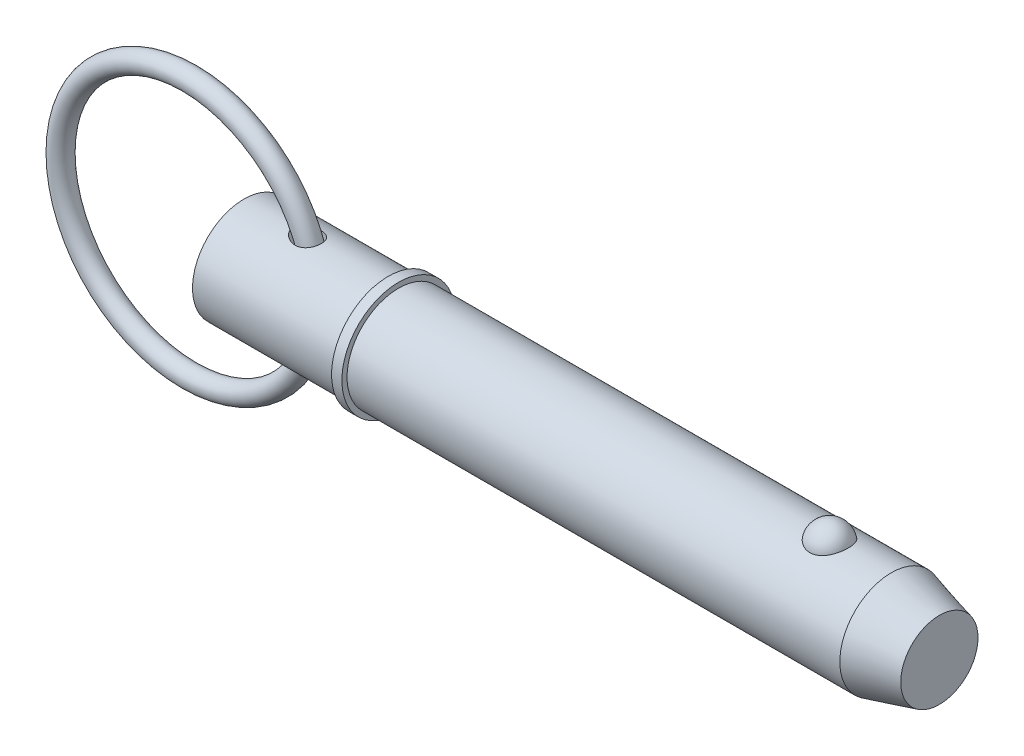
ISO-10303-21;
HEADER;
FILE_DESCRIPTION(('STEP AP214'),'2;1');
FILE_NAME('part.step','',(''),(''),'','','');
FILE_SCHEMA(('AUTOMOTIVE_DESIGN { 1 0 10303 214 1 1 1 1 }'));
ENDSEC;
DATA;
#1=APPLICATION_CONTEXT('core data for automotive mechanical design processes');
#2=APPLICATION_PROTOCOL_DEFINITION('international standard','automotive_design',2000,#1);
#3=PRODUCT_CONTEXT('',#1,'mechanical');
#4=PRODUCT('Part','Part','',(#3));
#5=PRODUCT_RELATED_PRODUCT_CATEGORY('part','',(#4));
#6=PRODUCT_DEFINITION_FORMATION('','',#4);
#7=PRODUCT_DEFINITION_CONTEXT('part definition',#1,'design');
#8=PRODUCT_DEFINITION('design','',#6,#7);
#9=PRODUCT_DEFINITION_SHAPE('','',#8);
#10=(LENGTH_UNIT() NAMED_UNIT(*) SI_UNIT(.MILLI.,.METRE.));
#11=(NAMED_UNIT(*) PLANE_ANGLE_UNIT() SI_UNIT($,.RADIAN.));
#12=(NAMED_UNIT(*) SI_UNIT($,.STERADIAN.) SOLID_ANGLE_UNIT());
#13=UNCERTAINTY_MEASURE_WITH_UNIT(LENGTH_MEASURE(1.E-05),#10,'distance_accuracy_value','');
#14=(GEOMETRIC_REPRESENTATION_CONTEXT(3) GLOBAL_UNCERTAINTY_ASSIGNED_CONTEXT((#13)) GLOBAL_UNIT_ASSIGNED_CONTEXT((#10,
#11,#12)) REPRESENTATION_CONTEXT('',''));
#15=CARTESIAN_POINT('',(0.,0.,0.));
#16=DIRECTION('',(0.,0.,1.));
#17=DIRECTION('',(1.,0.,0.));
#18=AXIS2_PLACEMENT_3D('',#15,#16,#17);
#19=CARTESIAN_POINT('',(-13.4840686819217,0.,0.));
#20=DIRECTION('',(0.,0.,1.));
#21=DIRECTION('',(1.,0.,0.));
#22=AXIS2_PLACEMENT_3D('',#19,#20,#21);
#23=TOROIDAL_SURFACE('',#22,31.75,2.54);
#24=CARTESIAN_POINT('',(20.8059313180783,0.,0.));
#25=VERTEX_POINT('',#24);
#26=VERTEX_LOOP('',#25);
#27=FACE_BOUND('',#26,.T.);
#28=ADVANCED_FACE('P0_F12',(#27),#23,.T.);
#29=CLOSED_SHELL('',(#28));
#30=MANIFOLD_SOLID_BREP('P0_B1',#29);
#31=CARTESIAN_POINT('',(0.,0.,0.));
#32=DIRECTION('',(1.,0.,0.));
#33=DIRECTION('',(0.,0.,-1.));
#34=AXIS2_PLACEMENT_3D('',#31,#32,#33);
#35=CYLINDRICAL_SURFACE('',#34,12.7);
#36=CARTESIAN_POINT('',(13.092900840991,12.5230976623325,-2.11234992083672));
#37=CARTESIAN_POINT('',(13.2535855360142,12.4976398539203,-2.26328363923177));
#38=CARTESIAN_POINT('',(13.4280602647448,12.4718592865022,-2.39955782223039));
#39=CARTESIAN_POINT('',(13.7976341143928,12.4229301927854,-2.64122157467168));
#40=CARTESIAN_POINT('',(13.9927568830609,12.3997847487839,-2.7465751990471));
#41=CARTESIAN_POINT('',(14.397672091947,12.3590534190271,-2.92439761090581));
#42=CARTESIAN_POINT('',(14.6074445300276,12.3414601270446,-2.99691026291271));
#43=CARTESIAN_POINT('',(15.0366557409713,12.3142893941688,-3.10669649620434));
#44=CARTESIAN_POINT('',(15.2560902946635,12.3047084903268,-3.14398530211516));
#45=CARTESIAN_POINT('',(15.5877843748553,12.2976819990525,-3.17128282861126));
#46=CARTESIAN_POINT('',(15.6989364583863,12.2965677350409,-3.17559470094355));
#47=CARTESIAN_POINT('',(15.9211629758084,12.2969101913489,-3.17427486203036));
#48=CARTESIAN_POINT('',(16.0322374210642,12.2983656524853,-3.16864802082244));
#49=CARTESIAN_POINT('',(16.2532861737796,12.3038832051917,-3.14715368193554));
#50=CARTESIAN_POINT('',(16.363260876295,12.3079443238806,-3.13129000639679));
#51=CARTESIAN_POINT('',(16.5810669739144,12.3185954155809,-3.08912320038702));
#52=CARTESIAN_POINT('',(16.6888986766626,12.3251850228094,-3.06282157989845));
#53=CARTESIAN_POINT('',(16.8894247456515,12.3398294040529,-3.00323791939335));
#54=CARTESIAN_POINT('',(16.9824664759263,12.3476389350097,-2.97106098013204));
#55=CARTESIAN_POINT('',(17.1651267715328,12.3648759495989,-2.89848824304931));
#56=CARTESIAN_POINT('',(17.2547457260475,12.3743032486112,-2.85809338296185));
#57=CARTESIAN_POINT('',(17.4297224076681,12.3944822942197,-2.76927391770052));
#58=CARTESIAN_POINT('',(17.5150817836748,12.40523352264,-2.72085245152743));
#59=CARTESIAN_POINT('',(17.6807665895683,12.4277046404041,-2.61629867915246));
#60=CARTESIAN_POINT('',(17.7610923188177,12.4394244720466,-2.56016683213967));
#61=CARTESIAN_POINT('',(17.9797287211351,12.4733252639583,-2.39133767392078));
#62=CARTESIAN_POINT('',(18.1114611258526,12.4961902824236,-2.27005507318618));
#63=CARTESIAN_POINT('',(18.3518677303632,12.5412050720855,-2.00648954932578));
#64=CARTESIAN_POINT('',(18.4605454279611,12.5633549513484,-1.86420981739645));
#65=CARTESIAN_POINT('',(18.6498843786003,12.6039384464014,-1.5661481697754));
#66=CARTESIAN_POINT('',(18.7311185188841,12.622444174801,-1.41073996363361));
#67=CARTESIAN_POINT('',(18.8669149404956,12.6543302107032,-1.08819514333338));
#68=CARTESIAN_POINT('',(18.921477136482,12.6677105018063,-0.921058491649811));
#69=CARTESIAN_POINT('',(19.0028875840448,12.6879542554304,-0.57902988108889));
#70=CARTESIAN_POINT('',(19.0296164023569,12.6947896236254,-0.40410783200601));
#71=CARTESIAN_POINT('',(19.0543673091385,12.7011128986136,-0.0521104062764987));
#72=CARTESIAN_POINT('',(19.0523885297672,12.7006005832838,0.124965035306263));
#73=CARTESIAN_POINT('',(19.019700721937,12.692266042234,0.476969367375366));
#74=CARTESIAN_POINT('',(18.9888798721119,12.6844153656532,0.651887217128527));
#75=CARTESIAN_POINT('',(18.8990221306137,12.6622099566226,0.99389064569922));
#76=CARTESIAN_POINT('',(18.839985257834,12.6478552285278,1.16097622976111));
#77=CARTESIAN_POINT('',(18.6951419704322,12.6142309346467,1.48231767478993));
#78=CARTESIAN_POINT('',(18.6093706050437,12.5949678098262,1.63659000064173));
#79=CARTESIAN_POINT('',(18.4131352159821,12.5536490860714,1.92810749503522));
#80=CARTESIAN_POINT('',(18.3026732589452,12.5315937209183,2.06535408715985));
#81=CARTESIAN_POINT('',(18.060669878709,12.4872833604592,2.31822774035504));
#82=CARTESIAN_POINT('',(17.9292520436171,12.4650302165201,2.43397343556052));
#83=CARTESIAN_POINT('',(17.6485957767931,12.4226514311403,2.64178289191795));
#84=CARTESIAN_POINT('',(17.4993587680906,12.4025256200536,2.73384854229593));
#85=CARTESIAN_POINT('',(17.1869531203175,12.3664726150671,2.8925825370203));
#86=CARTESIAN_POINT('',(17.0237450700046,12.3505578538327,2.95917592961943));
#87=CARTESIAN_POINT('',(16.6884731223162,12.3245177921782,3.06582547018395));
#88=CARTESIAN_POINT('',(16.516407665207,12.3143935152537,3.10587692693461));
#89=CARTESIAN_POINT('',(16.1604213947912,12.3003788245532,3.16093927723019));
#90=CARTESIAN_POINT('',(15.9763106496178,12.2967791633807,3.17478342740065));
#91=CARTESIAN_POINT('',(15.6080973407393,12.2966663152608,3.1752118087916));
#92=CARTESIAN_POINT('',(15.4239948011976,12.3001555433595,3.16178674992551));
#93=CARTESIAN_POINT('',(15.0417156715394,12.3141744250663,3.10676725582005));
#94=CARTESIAN_POINT('',(14.8439465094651,12.3253658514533,3.06251977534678));
#95=CARTESIAN_POINT('',(14.4574652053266,12.3538942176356,2.94531863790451));
#96=CARTESIAN_POINT('',(14.2687614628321,12.3712367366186,2.87233891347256));
#97=CARTESIAN_POINT('',(13.8856104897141,12.4121323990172,2.69045747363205));
#98=CARTESIAN_POINT('',(13.6926012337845,12.4361434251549,2.57861276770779));
#99=CARTESIAN_POINT('',(13.328588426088,12.4862632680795,2.32379935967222));
#100=CARTESIAN_POINT('',(13.1575718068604,12.5123708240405,2.18084927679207));
#101=CARTESIAN_POINT('',(12.8776146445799,12.5579467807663,1.89840233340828));
#102=CARTESIAN_POINT('',(12.7631663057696,12.5776642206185,1.76440341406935));
#103=CARTESIAN_POINT('',(12.5574911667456,12.6143643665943,1.47931295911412));
#104=CARTESIAN_POINT('',(12.4662309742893,12.6313509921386,1.32824646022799));
#105=CARTESIAN_POINT('',(12.3240650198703,12.6583901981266,1.03598403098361));
#106=CARTESIAN_POINT('',(12.2691183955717,12.6691064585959,0.89682285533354));
#107=CARTESIAN_POINT('',(12.1828741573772,12.6860954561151,0.611068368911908));
#108=CARTESIAN_POINT('',(12.1515620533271,12.6923709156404,0.464479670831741));
#109=CARTESIAN_POINT('',(12.1147168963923,12.6997676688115,0.167420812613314));
#110=CARTESIAN_POINT('',(12.109270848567,12.7008715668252,0.0169392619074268));
#111=CARTESIAN_POINT('',(12.1248234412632,12.6977391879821,-0.282592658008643));
#112=CARTESIAN_POINT('',(12.1458245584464,12.6935024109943,-0.431642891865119));
#113=CARTESIAN_POINT('',(12.210908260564,12.6805581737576,-0.716008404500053));
#114=CARTESIAN_POINT('',(12.2537133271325,12.6720986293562,-0.851633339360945));
#115=CARTESIAN_POINT('',(12.3591295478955,12.6516826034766,-1.11460776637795));
#116=CARTESIAN_POINT('',(12.4217455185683,12.6397252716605,-1.24195523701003));
#117=CARTESIAN_POINT('',(12.5735635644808,12.61152213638,-1.50300095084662));
#118=CARTESIAN_POINT('',(12.6652159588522,12.5949150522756,-1.63522875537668));
#119=CARTESIAN_POINT('',(12.8664347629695,12.5599626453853,-1.88501670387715));
#120=CARTESIAN_POINT('',(12.9760196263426,12.541615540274,-2.00256151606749));
#121=CARTESIAN_POINT('',(13.092900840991,12.5230976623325,-2.11234992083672));
#122=B_SPLINE_CURVE_WITH_KNOTS('',3,(#36,#37,#38,#39,#40,#41,#42,#43,#44,#45,#46,#47,#48,#49,
#50,#51,#52,#53,#54,#55,#56,#57,#58,#59,#60,#61,#62,#63,#64,#65,#66,#67,#68,#69,#70,#71,#72,#73,
#74,#75,#76,#77,#78,#79,#80,#81,#82,#83,#84,#85,#86,#87,#88,#89,#90,#91,#92,#93,#94,#95,#96,#97,
#98,#99,#100,#101,#102,#103,#104,#105,#106,#107,#108,#109,#110,#111,#112,#113,#114,#115,#116,
#117,#118,#119,#120,#121),.UNSPECIFIED.,.T.,.F.,(4,2,2,2,2,2,2,2,2,2,2,2,2,2,2,2,2,2,2,2,2,2,2,
2,2,2,2,2,2,2,2,2,2,2,2,2,2,2,2,2,2,2,4),(0.,0.665132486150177,1.33103515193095,
1.99604575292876,2.66076878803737,2.99410229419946,3.32727250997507,3.66031840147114,
3.99331613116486,4.28918991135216,4.58502994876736,4.88075456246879,5.17646157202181,
5.71510826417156,6.25367317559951,6.78017774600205,7.30668400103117,7.83544030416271,
8.36421259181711,8.89504347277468,9.42587399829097,9.95601150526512,10.4861046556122,
11.0131799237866,11.54021312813,12.0687854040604,12.597451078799,13.1491450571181,
13.7010270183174,14.3074556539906,14.914435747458,15.5844380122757,16.2540403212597,
16.7839879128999,17.3131679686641,17.7612578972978,18.2090728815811,18.658393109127,
19.1077554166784,19.5333866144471,19.959121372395,20.4424347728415,20.9262486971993),.UNSPECIFIED.);
#123=CARTESIAN_POINT('',(13.092900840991,12.5230976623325,-2.11234992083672));
#124=VERTEX_POINT('',#123);
#125=EDGE_CURVE('P1_E42',#124,#124,#122,.T.);
#126=ORIENTED_EDGE('',*,*,#125,.T.);
#127=EDGE_LOOP('',(#126));
#128=FACE_BOUND('',#127,.T.);
#129=CARTESIAN_POINT('',(0.,0.,0.));
#130=DIRECTION('',(1.,0.,0.));
#131=DIRECTION('',(0.,0.,-1.));
#132=AXIS2_PLACEMENT_3D('',#129,#130,#131);
#133=CIRCLE('',#132,12.7);
#134=CARTESIAN_POINT('',(0.,0.,-12.7));
#135=VERTEX_POINT('',#134);
#136=EDGE_CURVE('P1_E9',#135,#135,#133,.T.);
#137=ORIENTED_EDGE('',*,*,#136,.T.);
#138=EDGE_LOOP('',(#137));
#139=FACE_BOUND('',#138,.T.);
#140=CARTESIAN_POINT('',(35.56,0.,0.));
#141=DIRECTION('',(1.,0.,0.));
#142=DIRECTION('',(0.,0.,-1.));
#143=AXIS2_PLACEMENT_3D('',#140,#141,#142);
#144=CIRCLE('',#143,12.7);
#145=CARTESIAN_POINT('',(35.56,0.,-12.7));
#146=VERTEX_POINT('',#145);
#147=EDGE_CURVE('P1_E25',#146,#146,#144,.T.);
#148=ORIENTED_EDGE('',*,*,#147,.F.);
#149=EDGE_LOOP('',(#148));
#150=FACE_BOUND('',#149,.T.);
#151=CARTESIAN_POINT('',(13.092900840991,-12.5230976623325,-2.11234992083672));
#152=CARTESIAN_POINT('',(12.9659872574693,-12.5432050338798,-1.99314161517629));
#153=CARTESIAN_POINT('',(12.847667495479,-12.5631124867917,-1.86478966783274));
#154=CARTESIAN_POINT('',(12.6324721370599,-12.6007427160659,-1.59069749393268));
#155=CARTESIAN_POINT('',(12.5355833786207,-12.6184668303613,-1.444968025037));
#156=CARTESIAN_POINT('',(12.4099071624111,-12.642034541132,-1.21450950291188));
#157=CARTESIAN_POINT('',(12.3711427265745,-12.6494175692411,-1.13527163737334));
#158=CARTESIAN_POINT('',(12.3010994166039,-12.6628962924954,-0.973464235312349));
#159=CARTESIAN_POINT('',(12.2698164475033,-12.6689926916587,-0.890896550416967));
#160=CARTESIAN_POINT('',(12.2153933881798,-12.6796767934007,-0.72309085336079));
#161=CARTESIAN_POINT('',(12.192246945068,-12.6842656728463,-0.637854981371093));
#162=CARTESIAN_POINT('',(12.154603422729,-12.6917620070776,-0.465421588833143));
#163=CARTESIAN_POINT('',(12.1401047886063,-12.69466976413,-0.378224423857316));
#164=CARTESIAN_POINT('',(12.1214471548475,-12.6984180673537,-0.214417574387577));
#165=CARTESIAN_POINT('',(12.1161713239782,-12.699481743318,-0.13793855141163));
#166=CARTESIAN_POINT('',(12.1124989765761,-12.7002217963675,0.0152189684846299));
#167=CARTESIAN_POINT('',(12.1141046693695,-12.6998977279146,0.0918975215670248));
#168=CARTESIAN_POINT('',(12.1241695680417,-12.6978712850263,0.244746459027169));
#169=CARTESIAN_POINT('',(12.132625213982,-12.6961696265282,0.320917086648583));
#170=CARTESIAN_POINT('',(12.1562110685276,-12.6914452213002,0.472185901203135));
#171=CARTESIAN_POINT('',(12.1713438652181,-12.6884219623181,0.547283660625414));
#172=CARTESIAN_POINT('',(12.223731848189,-12.6780227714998,0.759415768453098));
#173=CARTESIAN_POINT('',(12.268839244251,-12.6691353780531,0.894507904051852));
#174=CARTESIAN_POINT('',(12.3786059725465,-12.6479567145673,1.1560647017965));
#175=CARTESIAN_POINT('',(12.4432700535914,-12.6356646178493,1.28252725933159));
#176=CARTESIAN_POINT('',(12.5971341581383,-12.607236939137,1.5381272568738));
#177=CARTESIAN_POINT('',(12.6882234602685,-12.5908303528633,1.66609325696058));
#178=CARTESIAN_POINT('',(12.887209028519,-12.5564642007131,1.90792082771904));
#179=CARTESIAN_POINT('',(12.995115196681,-12.5385037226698,2.02177401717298));
#180=CARTESIAN_POINT('',(13.2471335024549,-12.4987806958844,2.25547266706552));
#181=CARTESIAN_POINT('',(13.3941979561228,-12.4769622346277,2.3721269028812));
#182=CARTESIAN_POINT('',(13.7036983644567,-12.4349587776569,2.58329351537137));
#183=CARTESIAN_POINT('',(13.8661464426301,-12.4147750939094,2.67778822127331));
#184=CARTESIAN_POINT('',(14.2306024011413,-12.3748157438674,2.85722657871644));
#185=CARTESIAN_POINT('',(14.4347220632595,-12.3556533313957,2.93804226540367));
#186=CARTESIAN_POINT('',(14.8540416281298,-12.3245430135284,3.06594877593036));
#187=CARTESIAN_POINT('',(15.0692453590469,-12.3125976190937,3.11302786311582));
#188=CARTESIAN_POINT('',(15.3981213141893,-12.3014943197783,3.15648626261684));
#189=CARTESIAN_POINT('',(15.5100235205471,-12.298940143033,3.16639841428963));
#190=CARTESIAN_POINT('',(15.7342812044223,-12.2963942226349,3.17627668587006));
#191=CARTESIAN_POINT('',(15.8466364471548,-12.2964012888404,3.17624742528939));
#192=CARTESIAN_POINT('',(16.0707903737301,-12.2990694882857,3.16589868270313));
#193=CARTESIAN_POINT('',(16.1825892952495,-12.3017293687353,3.1555840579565));
#194=CARTESIAN_POINT('',(16.4046123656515,-12.3096862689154,3.12440163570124));
#195=CARTESIAN_POINT('',(16.514836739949,-12.314982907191,3.10353536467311));
#196=CARTESIAN_POINT('',(16.7211934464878,-12.3273933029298,3.05384263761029));
#197=CARTESIAN_POINT('',(16.8175961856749,-12.3342598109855,3.0260738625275));
#198=CARTESIAN_POINT('',(17.0073515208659,-12.3498131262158,2.96195947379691));
#199=CARTESIAN_POINT('',(17.100704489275,-12.3584997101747,2.92561491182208));
#200=CARTESIAN_POINT('',(17.2834584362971,-12.3774243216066,2.84448580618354));
#201=CARTESIAN_POINT('',(17.3728610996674,-12.3876616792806,2.79970490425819));
#202=CARTESIAN_POINT('',(17.5469061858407,-12.409352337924,2.701939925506));
#203=CARTESIAN_POINT('',(17.6315489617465,-12.4208055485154,2.64895645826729));
#204=CARTESIAN_POINT('',(17.7872886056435,-12.4433734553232,2.54070972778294));
#205=CARTESIAN_POINT('',(17.8589017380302,-12.4544123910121,2.4861716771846));
#206=CARTESIAN_POINT('',(17.9970802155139,-12.4768404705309,2.37105291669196));
#207=CARTESIAN_POINT('',(18.063643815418,-12.4882297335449,2.31047013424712));
#208=CARTESIAN_POINT('',(18.1911677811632,-12.5110137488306,2.18372894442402));
#209=CARTESIAN_POINT('',(18.2521311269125,-12.5224084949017,2.11757353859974));
#210=CARTESIAN_POINT('',(18.3680676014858,-12.5448751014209,1.98014449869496));
#211=CARTESIAN_POINT('',(18.4230385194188,-12.5559468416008,1.90886899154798));
#212=CARTESIAN_POINT('',(18.5752306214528,-12.5875288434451,1.6925769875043));
#213=CARTESIAN_POINT('',(18.6637018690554,-12.6071482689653,1.54111740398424));
#214=CARTESIAN_POINT('',(18.8143485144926,-12.6417556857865,1.225260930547));
#215=CARTESIAN_POINT('',(18.876524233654,-12.6567437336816,1.06086419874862));
#216=CARTESIAN_POINT('',(18.9733884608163,-12.6805238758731,0.723195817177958));
#217=CARTESIAN_POINT('',(19.0079967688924,-12.6892978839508,0.549899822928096));
#218=CARTESIAN_POINT('',(19.0486500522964,-12.6996362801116,0.199781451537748));
#219=CARTESIAN_POINT('',(19.054694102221,-12.7012004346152,0.0229589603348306));
#220=CARTESIAN_POINT('',(19.0380549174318,-12.6969431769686,-0.330044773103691));
#221=CARTESIAN_POINT('',(19.0152419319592,-12.6910884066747,-0.506219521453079));
#222=CARTESIAN_POINT('',(18.9411599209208,-12.672565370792,-0.852112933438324));
#223=CARTESIAN_POINT('',(18.8898907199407,-12.659897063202,-1.0218315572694));
#224=CARTESIAN_POINT('',(18.7600888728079,-12.6291327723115,-1.34987035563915));
#225=CARTESIAN_POINT('',(18.6815715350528,-12.6110398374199,-1.50819687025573));
#226=CARTESIAN_POINT('',(18.4991526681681,-12.5714188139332,-1.808997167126));
#227=CARTESIAN_POINT('',(18.3952529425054,-12.5498909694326,-1.95147207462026));
#228=CARTESIAN_POINT('',(18.1653806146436,-12.5059234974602,-2.21580059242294));
#229=CARTESIAN_POINT('',(18.0395297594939,-12.4834893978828,-2.33776101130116));
#230=CARTESIAN_POINT('',(17.7688701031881,-12.4400863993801,-2.55870399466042));
#231=CARTESIAN_POINT('',(17.624063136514,-12.4191173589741,-2.65768878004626));
#232=CARTESIAN_POINT('',(17.3196803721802,-12.380896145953,-2.8304192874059));
#233=CARTESIAN_POINT('',(17.1601036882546,-12.3636441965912,-2.90416349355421));
#234=CARTESIAN_POINT('',(16.8308162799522,-12.3345597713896,-3.02531546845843));
#235=CARTESIAN_POINT('',(16.6611041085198,-12.322728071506,-3.07271946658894));
#236=CARTESIAN_POINT('',(16.3099674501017,-12.3051318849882,-3.14246490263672));
#237=CARTESIAN_POINT('',(16.1283412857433,-12.2996014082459,-3.16384159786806));
#238=CARTESIAN_POINT('',(15.7639014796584,-12.2955807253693,-3.17942379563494));
#239=CARTESIAN_POINT('',(15.5810875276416,-12.2970924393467,-3.17362188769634));
#240=CARTESIAN_POINT('',(15.20154276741,-12.307074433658,-3.13470416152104));
#241=CARTESIAN_POINT('',(15.0050835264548,-12.316173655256,-3.09911848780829));
#242=CARTESIAN_POINT('',(14.6197996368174,-12.3407987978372,-2.99954607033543));
#243=CARTESIAN_POINT('',(14.4309834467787,-12.3563316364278,-2.93552875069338));
#244=CARTESIAN_POINT('',(14.0353751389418,-12.3949378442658,-2.76840280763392));
#245=CARTESIAN_POINT('',(13.8306109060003,-12.4188242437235,-2.66064798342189));
#246=CARTESIAN_POINT('',(13.4432099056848,-12.4696241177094,-2.4113475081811));
#247=CARTESIAN_POINT('',(13.2605568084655,-12.4965353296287,-2.26982702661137));
#248=CARTESIAN_POINT('',(13.092900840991,-12.5230976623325,-2.11234992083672));
#249=B_SPLINE_CURVE_WITH_KNOTS('',3,(#151,#152,#153,#154,#155,#156,#157,#158,#159,#160,#161,
#162,#163,#164,#165,#166,#167,#168,#169,#170,#171,#172,#173,#174,#175,#176,#177,#178,#179,#180,
#181,#182,#183,#184,#185,#186,#187,#188,#189,#190,#191,#192,#193,#194,#195,#196,#197,#198,#199,
#200,#201,#202,#203,#204,#205,#206,#207,#208,#209,#210,#211,#212,#213,#214,#215,#216,#217,#218,
#219,#220,#221,#222,#223,#224,#225,#226,#227,#228,#229,#230,#231,#232,#233,#234,#235,#236,#237,
#238,#239,#240,#241,#242,#243,#244,#245,#246,#247,#248),.UNSPECIFIED.,.T.,.F.,(4,2,2,2,2,2,2,2,
2,2,2,2,2,2,2,2,2,2,2,2,2,2,2,2,2,2,2,2,2,2,2,2,2,2,2,2,2,2,2,2,2,2,2,2,2,2,2,2,4),(0.,
0.525289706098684,1.05025590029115,1.31549608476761,1.58059075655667,1.84547798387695,
2.11031756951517,2.34000998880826,2.56977615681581,2.79942299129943,3.0291589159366,
3.45531787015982,3.8815803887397,4.35362362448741,4.82594586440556,5.39074449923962,
5.95599200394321,6.61421946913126,7.27267581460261,7.60939383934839,7.94595540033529,
8.2823580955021,8.61871213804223,8.91997243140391,9.22119579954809,9.52228943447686,
9.82336070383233,10.0950952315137,10.3669232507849,10.6386057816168,10.9103882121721,
11.4371688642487,11.9639430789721,12.4922442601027,13.0205625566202,13.5512648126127,
14.0819703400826,14.6123781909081,15.1427483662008,15.6702654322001,16.1977314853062,
16.7252292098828,17.2528024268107,17.7993878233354,18.3461222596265,18.9432829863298,
19.5410874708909,20.2355241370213,20.9294447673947),.UNSPECIFIED.);
#250=CARTESIAN_POINT('',(13.092900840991,-12.5230976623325,-2.11234992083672));
#251=VERTEX_POINT('',#250);
#252=EDGE_CURVE('P1_E17',#251,#251,#249,.T.);
#253=ORIENTED_EDGE('',*,*,#252,.T.);
#254=EDGE_LOOP('',(#253));
#255=FACE_BOUND('',#254,.T.);
#256=ADVANCED_FACE('P1_F13',(#128,#139,#150,#255),#35,.T.);
#257=CARTESIAN_POINT('',(0.,0.,0.));
#258=DIRECTION('',(1.,0.,0.));
#259=DIRECTION('',(0.,0.,-1.));
#260=AXIS2_PLACEMENT_3D('',#257,#258,#259);
#261=CYLINDRICAL_SURFACE('',#260,12.7);
#262=CARTESIAN_POINT('',(159.600738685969,0.,0.));
#263=DIRECTION('',(1.,0.,0.));
#264=DIRECTION('',(0.,0.,-1.));
#265=AXIS2_PLACEMENT_3D('',#262,#263,#264);
#266=CIRCLE('',#265,12.7);
#267=CARTESIAN_POINT('',(159.600738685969,0.,-12.7));
#268=VERTEX_POINT('',#267);
#269=EDGE_CURVE('P1_E99',#268,#268,#266,.T.);
#270=ORIENTED_EDGE('',*,*,#269,.F.);
#271=EDGE_LOOP('',(#270));
#272=FACE_BOUND('',#271,.T.);
#273=CARTESIAN_POINT('',(38.1,0.,0.));
#274=DIRECTION('',(1.,0.,0.));
#275=DIRECTION('',(0.,0.,-1.));
#276=AXIS2_PLACEMENT_3D('',#273,#274,#275);
#277=CIRCLE('',#276,12.7);
#278=CARTESIAN_POINT('',(38.1,0.,-12.7));
#279=VERTEX_POINT('',#278);
#280=EDGE_CURVE('P1_E96',#279,#279,#277,.T.);
#281=ORIENTED_EDGE('',*,*,#280,.T.);
#282=EDGE_LOOP('',(#281));
#283=FACE_BOUND('',#282,.T.);
#284=CARTESIAN_POINT('',(144.360042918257,11.7500437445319,4.81938502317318));
#285=CARTESIAN_POINT('',(144.235088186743,11.7500430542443,4.81938571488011));
#286=CARTESIAN_POINT('',(144.110144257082,11.7520975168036,4.81438658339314));
#287=CARTESIAN_POINT('',(143.861142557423,11.760253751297,4.79442904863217));
#288=CARTESIAN_POINT('',(143.737085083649,11.7663568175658,4.77946746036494));
#289=CARTESIAN_POINT('',(143.490901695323,11.7824262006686,4.73971414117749));
#290=CARTESIAN_POINT('',(143.368774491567,11.7923898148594,4.71492928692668));
#291=CARTESIAN_POINT('',(143.127187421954,11.8158938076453,4.65571340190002));
#292=CARTESIAN_POINT('',(143.00772859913,11.8294355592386,4.6212786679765));
#293=CARTESIAN_POINT('',(142.772557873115,11.8596812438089,4.54309502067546));
#294=CARTESIAN_POINT('',(142.656839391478,11.8763792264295,4.49936361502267));
#295=CARTESIAN_POINT('',(142.429653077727,11.9124878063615,4.40287235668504));
#296=CARTESIAN_POINT('',(142.318186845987,11.9318994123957,4.35010914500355));
#297=CARTESIAN_POINT('',(141.991278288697,11.9934256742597,4.17881316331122));
#298=CARTESIAN_POINT('',(141.783127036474,12.038858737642,4.04720756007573));
#299=CARTESIAN_POINT('',(141.385850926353,12.1352173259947,3.748564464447));
#300=CARTESIAN_POINT('',(141.197443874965,12.1862630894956,3.58061821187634));
#301=CARTESIAN_POINT('',(140.850521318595,12.2875163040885,3.21600758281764));
#302=CARTESIAN_POINT('',(140.692011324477,12.3377235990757,3.01933792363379));
#303=CARTESIAN_POINT('',(140.40168878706,12.4344923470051,2.59291655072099));
#304=CARTESIAN_POINT('',(140.271376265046,12.4807925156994,2.36208286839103));
#305=CARTESIAN_POINT('',(140.049407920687,12.5623454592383,1.88070399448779));
#306=CARTESIAN_POINT('',(139.957755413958,12.5975972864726,1.63015711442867));
#307=CARTESIAN_POINT('',(139.814046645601,12.6538414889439,1.1129886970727));
#308=CARTESIAN_POINT('',(139.762499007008,12.6746503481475,0.846205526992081));
#309=CARTESIAN_POINT('',(139.701977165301,12.699153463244,0.30708547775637));
#310=CARTESIAN_POINT('',(139.693001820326,12.7028481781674,0.034748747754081));
#311=CARTESIAN_POINT('',(139.717731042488,12.6927785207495,-0.506073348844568));
#312=CARTESIAN_POINT('',(139.751189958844,12.6791146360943,-0.774571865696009));
#313=CARTESIAN_POINT('',(139.859687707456,12.635882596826,-1.30170246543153));
#314=CARTESIAN_POINT('',(139.93472729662,12.606314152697,-1.56033436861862));
#315=CARTESIAN_POINT('',(140.12500006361,12.5342328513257,-2.0608389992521));
#316=CARTESIAN_POINT('',(140.240287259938,12.4917026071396,-2.30268867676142));
#317=CARTESIAN_POINT('',(140.508704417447,12.3981123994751,-2.76259600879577));
#318=CARTESIAN_POINT('',(140.661837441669,12.3470517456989,-2.98065173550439));
#319=CARTESIAN_POINT('',(141.003507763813,12.2416045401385,-3.38786328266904));
#320=CARTESIAN_POINT('',(141.192201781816,12.1872040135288,-3.57688418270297));
#321=CARTESIAN_POINT('',(141.600239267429,12.0814086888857,-3.91941073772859));
#322=CARTESIAN_POINT('',(141.819580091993,12.0300136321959,-4.07291945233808));
#323=CARTESIAN_POINT('',(142.278375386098,11.9373542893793,-4.33691289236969));
#324=CARTESIAN_POINT('',(142.517304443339,11.8958982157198,-4.44824125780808));
#325=CARTESIAN_POINT('',(143.01243761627,11.8268116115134,-4.62881985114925));
#326=CARTESIAN_POINT('',(143.268635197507,11.7991758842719,-4.69808589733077));
#327=CARTESIAN_POINT('',(143.777164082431,11.7622209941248,-4.78983181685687));
#328=CARTESIAN_POINT('',(144.029041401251,11.7520502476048,-4.81449025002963));
#329=CARTESIAN_POINT('',(144.533573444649,11.7485796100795,-4.82295735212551));
#330=CARTESIAN_POINT('',(144.786228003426,11.7552763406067,-4.80677420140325));
#331=CARTESIAN_POINT('',(145.276834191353,11.7842584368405,-4.73525430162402));
#332=CARTESIAN_POINT('',(145.514998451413,11.8060486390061,-4.68116061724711));
#333=CARTESIAN_POINT('',(145.978489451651,11.8622750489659,-4.53678133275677));
#334=CARTESIAN_POINT('',(146.203815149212,11.8967122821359,-4.44649279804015));
#335=CARTESIAN_POINT('',(146.640801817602,11.9754603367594,-4.22987613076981));
#336=CARTESIAN_POINT('',(146.852057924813,12.0199699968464,-4.10280539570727));
#337=CARTESIAN_POINT('',(147.250601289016,12.1138028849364,-3.81685409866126));
#338=CARTESIAN_POINT('',(147.437883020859,12.163127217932,-3.65796622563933));
#339=CARTESIAN_POINT('',(147.793350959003,12.2642343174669,-3.30364864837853));
#340=CARTESIAN_POINT('',(147.960111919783,12.3160165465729,-3.10678783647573));
#341=CARTESIAN_POINT('',(148.259579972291,12.4142566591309,-2.68748409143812));
#342=CARTESIAN_POINT('',(148.392280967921,12.4607135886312,-2.46503658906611));
#343=CARTESIAN_POINT('',(148.624691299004,12.5450236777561,-1.9928951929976));
#344=CARTESIAN_POINT('',(148.723215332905,12.5825557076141,-1.74255918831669));
#345=CARTESIAN_POINT('',(148.879227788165,12.6431720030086,-1.2277373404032));
#346=CARTESIAN_POINT('',(148.936715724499,12.6662560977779,-0.963251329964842));
#347=CARTESIAN_POINT('',(149.009544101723,12.6956486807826,-0.427355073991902));
#348=CARTESIAN_POINT('',(149.024837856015,12.7019385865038,-0.155937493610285));
#349=CARTESIAN_POINT('',(149.012779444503,12.6970201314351,0.385928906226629));
#350=CARTESIAN_POINT('',(148.98542805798,12.6858120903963,0.656377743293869));
#351=CARTESIAN_POINT('',(148.913060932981,12.6568455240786,1.05454017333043));
#352=CARTESIAN_POINT('',(148.883796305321,12.6451962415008,1.185778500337));
#353=CARTESIAN_POINT('',(148.815022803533,12.6181819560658,1.44513808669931));
#354=CARTESIAN_POINT('',(148.775517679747,12.6028183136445,1.57326046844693));
#355=CARTESIAN_POINT('',(148.686439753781,12.5687547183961,1.82554978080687));
#356=CARTESIAN_POINT('',(148.636862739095,12.5500533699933,1.9497150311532));
#357=CARTESIAN_POINT('',(148.52792115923,12.5098093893,2.19314370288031));
#358=CARTESIAN_POINT('',(148.468560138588,12.4882677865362,2.31240887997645));
#359=CARTESIAN_POINT('',(148.33997128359,12.4427679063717,2.54593031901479));
#360=CARTESIAN_POINT('',(148.270688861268,12.4187964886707,2.66015396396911));
#361=CARTESIAN_POINT('',(148.122903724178,12.3691892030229,2.88202659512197));
#362=CARTESIAN_POINT('',(148.044404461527,12.3435539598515,2.98967802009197));
#363=CARTESIAN_POINT('',(147.878550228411,12.2912955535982,3.19774385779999));
#364=CARTESIAN_POINT('',(147.791191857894,12.2646720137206,3.29815546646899));
#365=CARTESIAN_POINT('',(147.608161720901,12.2111945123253,3.49095035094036));
#366=CARTESIAN_POINT('',(147.512493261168,12.1843406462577,3.58333679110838));
#367=CARTESIAN_POINT('',(147.313627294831,12.1312249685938,3.75922876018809));
#368=CARTESIAN_POINT('',(147.210450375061,12.104961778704,3.84275713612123));
#369=CARTESIAN_POINT('',(146.99701336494,12.0537284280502,4.00056406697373));
#370=CARTESIAN_POINT('',(146.886756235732,12.028757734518,4.07484645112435));
#371=CARTESIAN_POINT('',(146.659755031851,11.9808306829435,4.21367959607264));
#372=CARTESIAN_POINT('',(146.543006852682,11.9578756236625,4.27822410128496));
#373=CARTESIAN_POINT('',(146.30394258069,11.9147184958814,4.39698483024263));
#374=CARTESIAN_POINT('',(146.181628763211,11.894515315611,4.45120522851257));
#375=CARTESIAN_POINT('',(145.922952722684,11.8561129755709,4.55255353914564));
#376=CARTESIAN_POINT('',(145.786223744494,11.8381764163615,4.59884858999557));
#377=CARTESIAN_POINT('',(145.508608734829,11.8069093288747,4.67853897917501));
#378=CARTESIAN_POINT('',(145.367724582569,11.7935767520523,4.71194005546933));
#379=CARTESIAN_POINT('',(145.08309446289,11.7720277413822,4.76552188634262));
#380=CARTESIAN_POINT('',(144.939348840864,11.7638106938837,4.78570422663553));
#381=CARTESIAN_POINT('',(144.650411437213,11.7528195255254,4.81263433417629));
#382=CARTESIAN_POINT('',(144.505219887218,11.7500445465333,4.81938421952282));
#383=CARTESIAN_POINT('',(144.360042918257,11.7500437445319,4.81938502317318));
#384=B_SPLINE_CURVE_WITH_KNOTS('',3,(#284,#285,#286,#287,#288,#289,#290,#291,#292,#293,#294,
#295,#296,#297,#298,#299,#300,#301,#302,#303,#304,#305,#306,#307,#308,#309,#310,#311,#312,#313,
#314,#315,#316,#317,#318,#319,#320,#321,#322,#323,#324,#325,#326,#327,#328,#329,#330,#331,#332,
#333,#334,#335,#336,#337,#338,#339,#340,#341,#342,#343,#344,#345,#346,#347,#348,#349,#350,#351,
#352,#353,#354,#355,#356,#357,#358,#359,#360,#361,#362,#363,#364,#365,#366,#367,#368,#369,#370,
#371,#372,#373,#374,#375,#376,#377,#378,#379,#380,#381,#382,#383),.UNSPECIFIED.,.T.,.F.,(4,2,2,
2,2,2,2,2,2,2,2,2,2,2,2,2,2,2,2,2,2,2,2,2,2,2,2,2,2,2,2,2,2,2,2,2,2,2,2,2,2,2,2,2,2,2,2,2,2,4),
(0.,0.374729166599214,0.749578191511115,1.12416526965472,1.49889629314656,1.87292776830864,
2.24709865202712,2.99481328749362,3.76399449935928,4.53331735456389,5.3368391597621,
6.14042986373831,6.95405296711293,7.76765424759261,8.57656703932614,9.38549455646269,
10.1955119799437,11.0055949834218,11.8193353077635,12.6330054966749,13.4294141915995,
14.2255231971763,14.9815786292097,15.7374826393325,16.4696948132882,17.2019663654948,
17.9501979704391,18.6986017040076,19.484470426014,20.2704797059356,21.0815215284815,
21.8925729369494,22.7045213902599,23.5164550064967,23.9209608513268,24.3253187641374,
24.7298461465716,25.1342272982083,25.54092555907,25.9474719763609,26.3541750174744,
26.7607169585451,27.1661834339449,27.5714814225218,27.9770386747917,28.3824315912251,
28.818120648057,29.2536155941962,29.6890582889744,30.1244323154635),.UNSPECIFIED.);
#385=CARTESIAN_POINT('',(144.360042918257,11.7500437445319,4.81938502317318));
#386=VERTEX_POINT('',#385);
#387=EDGE_CURVE('P1_E34',#386,#386,#384,.T.);
#388=ORIENTED_EDGE('',*,*,#387,.T.);
#389=EDGE_LOOP('',(#388));
#390=FACE_BOUND('',#389,.T.);
#391=ADVANCED_FACE('P1_F46',(#272,#283,#390),#261,.T.);
#392=CARTESIAN_POINT('',(0.,0.,0.));
#393=DIRECTION('',(-1.,0.,0.));
#394=DIRECTION('',(0.,0.,1.));
#395=AXIS2_PLACEMENT_3D('',#392,#393,#394);
#396=PLANE('',#395);
#397=ORIENTED_EDGE('',*,*,#136,.F.);
#398=EDGE_LOOP('',(#397));
#399=FACE_BOUND('',#398,.T.);
#400=ADVANCED_FACE('P1_F15',(#399),#396,.T.);
#401=CARTESIAN_POINT('',(35.56,12.7,0.));
#402=DIRECTION('',(-1.,0.,0.));
#403=DIRECTION('',(0.,0.,1.));
#404=AXIS2_PLACEMENT_3D('',#401,#402,#403);
#405=PLANE('',#404);
#406=ORIENTED_EDGE('',*,*,#147,.T.);
#407=EDGE_LOOP('',(#406));
#408=FACE_BOUND('',#407,.T.);
#409=CARTESIAN_POINT('',(35.56,0.,0.));
#410=DIRECTION('',(1.,0.,0.));
#411=DIRECTION('',(0.,0.,-1.));
#412=AXIS2_PLACEMENT_3D('',#409,#410,#411);
#413=CIRCLE('',#412,13.97);
#414=CARTESIAN_POINT('',(35.56,0.,-13.97));
#415=VERTEX_POINT('',#414);
#416=EDGE_CURVE('P1_E30',#415,#415,#413,.T.);
#417=ORIENTED_EDGE('',*,*,#416,.F.);
#418=EDGE_LOOP('',(#417));
#419=FACE_BOUND('',#418,.T.);
#420=ADVANCED_FACE('P1_F81',(#408,#419),#405,.T.);
#421=CARTESIAN_POINT('',(0.,0.,0.));
#422=DIRECTION('',(1.,0.,0.));
#423=DIRECTION('',(0.,0.,-1.));
#424=AXIS2_PLACEMENT_3D('',#421,#422,#423);
#425=CYLINDRICAL_SURFACE('',#424,13.97);
#426=ORIENTED_EDGE('',*,*,#416,.T.);
#427=EDGE_LOOP('',(#426));
#428=FACE_BOUND('',#427,.T.);
#429=CARTESIAN_POINT('',(38.1,0.,0.));
#430=DIRECTION('',(1.,0.,0.));
#431=DIRECTION('',(0.,0.,-1.));
#432=AXIS2_PLACEMENT_3D('',#429,#430,#431);
#433=CIRCLE('',#432,13.97);
#434=CARTESIAN_POINT('',(38.1,0.,-13.97));
#435=VERTEX_POINT('',#434);
#436=EDGE_CURVE('P1_E95',#435,#435,#433,.T.);
#437=ORIENTED_EDGE('',*,*,#436,.F.);
#438=EDGE_LOOP('',(#437));
#439=FACE_BOUND('',#438,.T.);
#440=ADVANCED_FACE('P1_F68',(#428,#439),#425,.T.);
#441=CARTESIAN_POINT('',(38.1,13.97,0.));
#442=DIRECTION('',(1.,0.,0.));
#443=DIRECTION('',(0.,0.,-1.));
#444=AXIS2_PLACEMENT_3D('',#441,#442,#443);
#445=PLANE('',#444);
#446=ORIENTED_EDGE('',*,*,#436,.T.);
#447=EDGE_LOOP('',(#446));
#448=FACE_BOUND('',#447,.T.);
#449=ORIENTED_EDGE('',*,*,#280,.F.);
#450=EDGE_LOOP('',(#449));
#451=FACE_BOUND('',#450,.T.);
#452=ADVANCED_FACE('P1_F62',(#448,#451),#445,.T.);
#453=CARTESIAN_POINT('',(171.45,0.,0.));
#454=DIRECTION('',(-1.,0.,0.));
#455=DIRECTION('',(0.,0.,1.));
#456=AXIS2_PLACEMENT_3D('',#453,#454,#455);
#457=CONICAL_SURFACE('',#456,9.52500000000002,0.261799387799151);
#458=ORIENTED_EDGE('',*,*,#269,.T.);
#459=EDGE_LOOP('',(#458));
#460=FACE_BOUND('',#459,.T.);
#461=CARTESIAN_POINT('',(171.45,0.,0.));
#462=DIRECTION('',(1.,0.,0.));
#463=DIRECTION('',(0.,0.,-1.));
#464=AXIS2_PLACEMENT_3D('',#461,#462,#463);
#465=CIRCLE('',#464,9.52500000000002);
#466=CARTESIAN_POINT('',(171.45,0.,-9.52500000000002));
#467=VERTEX_POINT('',#466);
#468=EDGE_CURVE('P1_E41',#467,#467,#465,.T.);
#469=ORIENTED_EDGE('',*,*,#468,.F.);
#470=EDGE_LOOP('',(#469));
#471=FACE_BOUND('',#470,.T.);
#472=ADVANCED_FACE('P1_F59',(#460,#471),#457,.T.);
#473=CARTESIAN_POINT('',(171.45,9.52500000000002,0.));
#474=DIRECTION('',(1.,0.,0.));
#475=DIRECTION('',(0.,0.,-1.));
#476=AXIS2_PLACEMENT_3D('',#473,#474,#475);
#477=PLANE('',#476);
#478=ORIENTED_EDGE('',*,*,#468,.T.);
#479=EDGE_LOOP('',(#478));
#480=FACE_BOUND('',#479,.T.);
#481=ADVANCED_FACE('P1_F55',(#480),#477,.T.);
#482=CARTESIAN_POINT('',(144.360042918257,11.43,0.));
#483=DIRECTION('',(-1.,0.,0.));
#484=DIRECTION('',(0.,1.,0.));
#485=AXIS2_PLACEMENT_3D('',#482,#483,#484);
#486=SPHERICAL_SURFACE('',#485,4.83);
#487=ORIENTED_EDGE('',*,*,#387,.F.);
#488=EDGE_LOOP('',(#487));
#489=FACE_BOUND('',#488,.T.);
#490=ADVANCED_FACE('P1_F50',(#489),#486,.T.);
#491=CARTESIAN_POINT('',(-13.4840686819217,0.,0.));
#492=DIRECTION('',(0.,0.,1.));
#493=DIRECTION('',(1.,0.,0.));
#494=AXIS2_PLACEMENT_3D('',#491,#492,#493);
#495=TOROIDAL_SURFACE('',#494,31.75,3.175);
#496=ORIENTED_EDGE('',*,*,#252,.F.);
#497=EDGE_LOOP('',(#496));
#498=FACE_BOUND('',#497,.T.);
#499=ORIENTED_EDGE('',*,*,#125,.F.);
#500=EDGE_LOOP('',(#499));
#501=FACE_BOUND('',#500,.T.);
#502=ADVANCED_FACE('P1_F54',(#498,#501),#495,.F.);
#503=CLOSED_SHELL('',(#256,#391,#400,#420,#440,#452,#472,#481,#490,#502));
#504=MANIFOLD_SOLID_BREP('P1_B1',#503);
#505=ADVANCED_BREP_SHAPE_REPRESENTATION('',(#18,#30,#504),#14);
#506=SHAPE_DEFINITION_REPRESENTATION(#9,#505);
ENDSEC;
END-ISO-10303-21;
